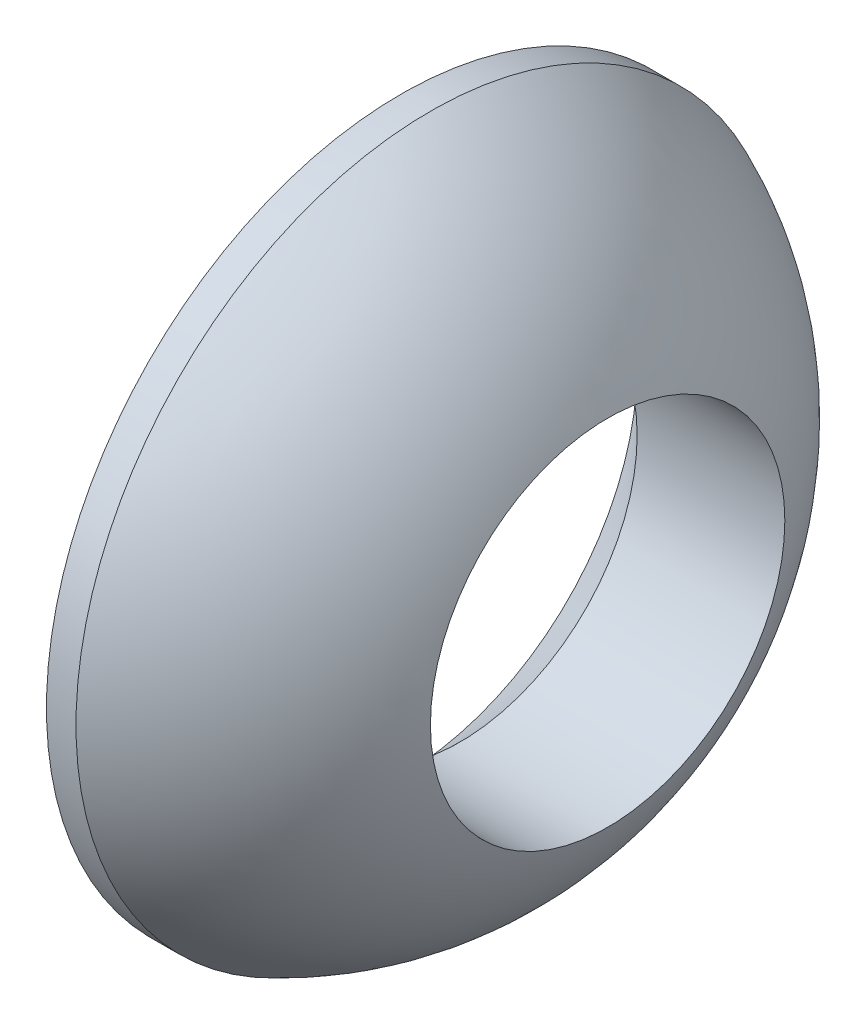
ISO-10303-21;
HEADER;
FILE_DESCRIPTION(('STEP AP214'),'2;1');
FILE_NAME('part.step','',(''),(''),'','','');
FILE_SCHEMA(('AUTOMOTIVE_DESIGN { 1 0 10303 214 1 1 1 1 }'));
ENDSEC;
DATA;
#1=APPLICATION_CONTEXT('core data for automotive mechanical design processes');
#2=APPLICATION_PROTOCOL_DEFINITION('international standard','automotive_design',2000,#1);
#3=PRODUCT_CONTEXT('',#1,'mechanical');
#4=PRODUCT('Part','Part','',(#3));
#5=PRODUCT_RELATED_PRODUCT_CATEGORY('part','',(#4));
#6=PRODUCT_DEFINITION_FORMATION('','',#4);
#7=PRODUCT_DEFINITION_CONTEXT('part definition',#1,'design');
#8=PRODUCT_DEFINITION('design','',#6,#7);
#9=PRODUCT_DEFINITION_SHAPE('','',#8);
#10=(LENGTH_UNIT() NAMED_UNIT(*) SI_UNIT(.MILLI.,.METRE.));
#11=(NAMED_UNIT(*) PLANE_ANGLE_UNIT() SI_UNIT($,.RADIAN.));
#12=(NAMED_UNIT(*) SI_UNIT($,.STERADIAN.) SOLID_ANGLE_UNIT());
#13=UNCERTAINTY_MEASURE_WITH_UNIT(LENGTH_MEASURE(1.E-05),#10,'distance_accuracy_value','');
#14=(GEOMETRIC_REPRESENTATION_CONTEXT(3) GLOBAL_UNCERTAINTY_ASSIGNED_CONTEXT((#13)) GLOBAL_UNIT_ASSIGNED_CONTEXT((#10,
#11,#12)) REPRESENTATION_CONTEXT('',''));
#15=CARTESIAN_POINT('',(0.,0.,0.));
#16=DIRECTION('',(0.,0.,1.));
#17=DIRECTION('',(1.,0.,0.));
#18=AXIS2_PLACEMENT_3D('',#15,#16,#17);
#19=CARTESIAN_POINT('',(0.,0.,0.));
#20=DIRECTION('',(1.,0.,0.));
#21=DIRECTION('',(0.,0.,-1.));
#22=AXIS2_PLACEMENT_3D('',#19,#20,#21);
#23=PLANE('',#22);
#24=CARTESIAN_POINT('',(0.,0.,0.));
#25=DIRECTION('',(1.,0.,0.));
#26=DIRECTION('',(0.,0.,-1.));
#27=AXIS2_PLACEMENT_3D('',#24,#25,#26);
#28=CIRCLE('',#27,4.);
#29=CARTESIAN_POINT('',(0.,0.,-4.));
#30=VERTEX_POINT('',#29);
#31=EDGE_CURVE('E37',#30,#30,#28,.T.);
#32=ORIENTED_EDGE('',*,*,#31,.T.);
#33=EDGE_LOOP('',(#32));
#34=FACE_BOUND('',#33,.T.);
#35=CARTESIAN_POINT('',(0.,0.,0.));
#36=DIRECTION('',(1.,0.,0.));
#37=DIRECTION('',(0.,0.,-1.));
#38=AXIS2_PLACEMENT_3D('',#35,#36,#37);
#39=CIRCLE('',#38,6.);
#40=CARTESIAN_POINT('',(0.,0.,-6.));
#41=VERTEX_POINT('',#40);
#42=EDGE_CURVE('E45',#41,#41,#39,.T.);
#43=ORIENTED_EDGE('',*,*,#42,.F.);
#44=EDGE_LOOP('',(#43));
#45=FACE_BOUND('',#44,.T.);
#46=ADVANCED_FACE('F30',(#34,#45),#23,.F.);
#47=CARTESIAN_POINT('',(-1.67555216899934,0.,0.));
#48=DIRECTION('',(1.,0.,0.));
#49=DIRECTION('',(0.,0.,-1.));
#50=AXIS2_PLACEMENT_3D('',#47,#48,#49);
#51=DEGENERATE_TOROIDAL_SURFACE('',#50,0.824447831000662,5.6142112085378,.T.);
#52=CARTESIAN_POINT('',(3.5,0.,0.));
#53=DIRECTION('',(-1.,0.,0.));
#54=DIRECTION('',(0.,0.,1.));
#55=AXIS2_PLACEMENT_3D('',#52,#53,#54);
#56=CIRCLE('',#55,3.);
#57=CARTESIAN_POINT('',(3.5,0.,3.));
#58=VERTEX_POINT('',#57);
#59=EDGE_CURVE('E50',#58,#58,#56,.F.);
#60=ORIENTED_EDGE('',*,*,#59,.F.);
#61=EDGE_LOOP('',(#60));
#62=FACE_BOUND('',#61,.T.);
#63=CARTESIAN_POINT('',(0.500000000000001,0.,0.));
#64=DIRECTION('',(1.,0.,0.));
#65=DIRECTION('',(0.,0.,-1.));
#66=AXIS2_PLACEMENT_3D('',#63,#64,#65);
#67=CIRCLE('',#66,6.);
#68=CARTESIAN_POINT('',(0.500000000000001,0.,-6.));
#69=VERTEX_POINT('',#68);
#70=EDGE_CURVE('E41',#69,#69,#67,.T.);
#71=ORIENTED_EDGE('',*,*,#70,.T.);
#72=EDGE_LOOP('',(#71));
#73=FACE_BOUND('',#72,.T.);
#74=ADVANCED_FACE('F32',(#62,#73),#51,.T.);
#75=CARTESIAN_POINT('',(3.50000000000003,0.,0.));
#76=DIRECTION('',(1.,0.,0.));
#77=DIRECTION('',(0.,0.,-1.));
#78=AXIS2_PLACEMENT_3D('',#75,#76,#77);
#79=CYLINDRICAL_SURFACE('',#78,6.);
#80=ORIENTED_EDGE('',*,*,#70,.F.);
#81=EDGE_LOOP('',(#80));
#82=FACE_BOUND('',#81,.T.);
#83=ORIENTED_EDGE('',*,*,#42,.T.);
#84=EDGE_LOOP('',(#83));
#85=FACE_BOUND('',#84,.T.);
#86=ADVANCED_FACE('F58',(#82,#85),#79,.T.);
#87=CARTESIAN_POINT('',(10.,0.,0.));
#88=DIRECTION('',(-1.,0.,0.));
#89=DIRECTION('',(0.,0.,1.));
#90=AXIS2_PLACEMENT_3D('',#87,#88,#89);
#91=CYLINDRICAL_SURFACE('',#90,3.);
#92=CARTESIAN_POINT('',(1.00000000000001,0.,0.));
#93=DIRECTION('',(1.,0.,0.));
#94=DIRECTION('',(0.,0.,-1.));
#95=AXIS2_PLACEMENT_3D('',#92,#93,#94);
#96=CIRCLE('',#95,3.);
#97=CARTESIAN_POINT('',(1.00000000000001,0.,-3.));
#98=VERTEX_POINT('',#97);
#99=EDGE_CURVE('E10',#98,#98,#96,.F.);
#100=ORIENTED_EDGE('',*,*,#99,.T.);
#101=EDGE_LOOP('',(#100));
#102=FACE_BOUND('',#101,.T.);
#103=ORIENTED_EDGE('',*,*,#59,.T.);
#104=EDGE_LOOP('',(#103));
#105=FACE_BOUND('',#104,.T.);
#106=ADVANCED_FACE('F54',(#102,#105),#91,.F.);
#107=CARTESIAN_POINT('',(0.,0.,0.));
#108=DIRECTION('',(-1.,0.,0.));
#109=DIRECTION('',(0.,0.,1.));
#110=AXIS2_PLACEMENT_3D('',#107,#108,#109);
#111=CONICAL_SURFACE('',#110,4.,0.785398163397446);
#112=ORIENTED_EDGE('',*,*,#99,.F.);
#113=EDGE_LOOP('',(#112));
#114=FACE_BOUND('',#113,.T.);
#115=ORIENTED_EDGE('',*,*,#31,.F.);
#116=EDGE_LOOP('',(#115));
#117=FACE_BOUND('',#116,.T.);
#118=ADVANCED_FACE('F72',(#114,#117),#111,.F.);
#119=CLOSED_SHELL('',(#46,#74,#86,#106,#118));
#120=MANIFOLD_SOLID_BREP('B2',#119);
#121=ADVANCED_BREP_SHAPE_REPRESENTATION('',(#18,#120),#14);
#122=SHAPE_DEFINITION_REPRESENTATION(#9,#121);
ENDSEC;
END-ISO-10303-21;
